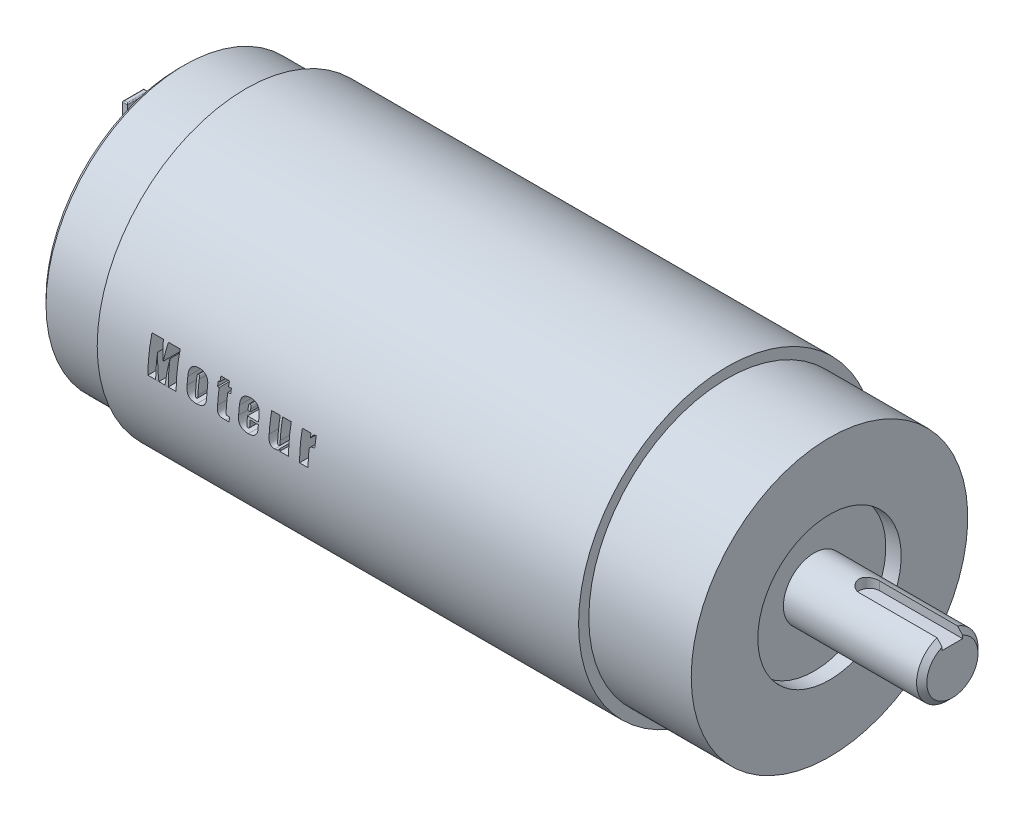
from build123d import *

# Parameters (mm, degrees)
CHANFREIN3_SIZE         = 0.5
ESQUISSE2_W             = 2
ESQUISSE2_H             = 1.5
ENL_V_MAT_EXTRU_1_DEPTH = 8.1
ESQUISSE3_R             = 1
ENL_V_MAT_EXTRU_2_DEPTH = 2.1
ENL_V_MAT_EXTRU_3_DEPTH = 2.1
BOSS_EXTRU_2_DEPTH      = 1.05
CONG_1_R                = 0.1


with BuildPart() as part:
    # Esquisse1 → Base-R_volution (revolve)
    with BuildSketch(Plane.XY, mode=Mode.PRIVATE) as base_r_volution_sk:
        with BuildLine():
            Line((12, 0), (12, 3))
            Line((12, 3), (-1.5, 3))
            Line((-1.5, 3), (-1.5, 7))
            Line((-1.5, 7), (0, 7))
            Line((0, 7), (0, 13.5))
            Line((0, 13.5), (-10, 13.5))
            Line((-10, 13.5), (-10, 14.5))
            Line((-10, 14.5), (-57, 14.5))
            Line((-57, 14.5), (-57, 13.5))
            Line((-57, 13.5), (-63, 13.5))
            Line((-63, 13.5), (-63.5, 13))
            Line((-63.5, 13), (-63.5, 8))
            ThreePointArc((-63.5, 8), (-64.207106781, 7.707106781), (-64.5, 7))
            Line((-64.5, 7), (-64.5, 0))
            Line((-64.5, 0), (12, 0))
        make_face()
    revolve(base_r_volution_sk.sketch.rotate(Axis((-76.5, 0, 0), (1, 0, 0)), 90), axis=Axis((-76.5, 0, 0), (1, 0, 0)))

    # Chanfrein3
    chanfrein3_edges = [part.edges().sort_by_distance(p)[0] for p in [
        (12, 0, -3),
    ]]
    chamfer(chanfrein3_edges, length=CHANFREIN3_SIZE)

    # Esquisse2 → Enl_v. mat.-Extru.1 (cut)
    with BuildSketch(Plane(origin=(12, 0, 0), x_dir=(0, 0, -1), z_dir=(1, 0, 0))):
        with Locations((0, 2.75)):
            Rectangle(ESQUISSE2_W, ESQUISSE2_H)
    extrude(amount=-ENL_V_MAT_EXTRU_1_DEPTH, mode=Mode.SUBTRACT)

    # Esquisse3 → Enl_v. mat.-Extru.2 (cut)
    with BuildSketch(Plane(origin=(0, 2, 0), x_dir=(-1, 0, 0), z_dir=(0, 1, 0))):
        with Locations((-3.9, 0)):
            Circle(ESQUISSE3_R)
    extrude(amount=ENL_V_MAT_EXTRU_2_DEPTH, mode=Mode.SUBTRACT)

    # Esquisse5 → Enl_v. mat.-Extru.3 (cut)
    # profile 1 of 6: a face of its own
    with BuildSketch(Plane.XY.offset(14.5)):
        with BuildLine():
            Line((-49.299123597, 3.393384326), (-49.299123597, 0))
            Line((-49.299123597, 0), (-50.057644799, 0))
            Line((-50.057644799, 0), (-50.077605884, 2.291158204))
            Line((-50.077605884, 2.291158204), (-50.377022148, 0))
            Line((-50.377022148, 0), (-50.975854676, 0))
            Line((-50.975854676, 0), (-51.27527094, 2.251236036))
            Line((-51.27527094, 2.251236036), (-51.295232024, 0))
            Line((-51.295232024, 0), (-52.053753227, 0))
            Line((-52.053753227, 0), (-52.053753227, 3.393384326))
            Line((-52.053753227, 3.393384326), (-50.94591305, 3.393384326))
            add(Edge.make_bspline(
                [(-50.94591305, 3.393384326), (-50.936773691, 3.340776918), (-50.917664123, 3.23077961), (-50.887600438, 3.058880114), (-50.855943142, 2.872721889), (-50.833857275, 2.744022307), (-50.822403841, 2.677280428)],
                knots=[0, 0, 0, 0, 0.881745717, 1.843650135, 2.881745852, 4, 4, 4, 4], degree=3))
            Line((-50.822403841, 2.677280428), (-50.676438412, 1.808973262))
            Line((-50.676438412, 1.808973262), (-50.446885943, 3.393384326))
            Line((-50.446885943, 3.393384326), (-49.299123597, 3.393384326))
        make_face()
    # profile 2 of 6: a face of its own
    with BuildSketch(Plane.XY.offset(14.5)):
        with BuildLine():
            Line((-46.344883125, 1.81022083), (-46.344883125, 1.130920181))
            add(Edge.make_bspline(
                [(-46.344883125, 1.130920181), (-46.344967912, 1.100768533), (-46.345131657, 1.042538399), (-46.3473617, 0.958336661), (-46.3492226, 0.880306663), (-46.35413174, 0.808612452), (-46.358451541, 0.743001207), (-46.365729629, 0.683801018), (-46.372852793, 0.630671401), (-46.384382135, 0.568225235), (-46.404301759, 0.495163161), (-46.438800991, 0.411384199), (-46.485249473, 0.331387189), (-46.540155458, 0.254185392), (-46.604961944, 0.183040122), (-46.680315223, 0.122344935), (-46.763390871, 0.070352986), (-46.85554118, 0.029541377), (-46.955529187, -0.001460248), (-47.062490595, -0.023601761), (-47.176424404, -0.037762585), (-47.254732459, -0.039189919), (-47.294905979, -0.039922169)],
                knots=[0, 0, 0, 0, 1.030820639, 1.990764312, 2.879836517, 3.698877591, 4.447479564, 5.127340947, 5.737592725, 6.27997261, 7.297519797, 8.320663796, 9.368189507, 10.453252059, 11.55504584, 12.646447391, 13.751149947, 14.896660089, 16.081551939, 17.323827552, 18.627072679, 20, 20, 20, 20], degree=3))
            add(Edge.make_bspline(
                [(-47.294905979, -0.039922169), (-47.339432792, -0.039331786), (-47.424916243, -0.038198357), (-47.547905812, -0.026065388), (-47.660369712, -0.007102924), (-47.762622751, 0.019096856), (-47.853913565, 0.054407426), (-47.935224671, 0.096316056), (-48.005305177, 0.147417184), (-48.06489423, 0.206214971), (-48.114319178, 0.272798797), (-48.156258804, 0.345506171), (-48.1905245, 0.424661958), (-48.213139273, 0.495537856), (-48.226884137, 0.55744323), (-48.236396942, 0.609842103), (-48.243322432, 0.66801972), (-48.250532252, 0.731374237), (-48.255450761, 0.800462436), (-48.258053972, 0.874951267), (-48.261064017, 0.954990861), (-48.261118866, 1.010110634), (-48.261147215, 1.038600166)],
                knots=[0, 0, 0, 0, 1.566851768, 3.008072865, 4.344862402, 5.578649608, 6.716279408, 7.783554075, 8.789251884, 9.757031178, 10.718730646, 11.699157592, 12.705361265, 13.749293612, 14.312132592, 14.936642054, 15.622938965, 16.373791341, 17.180992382, 18.06001777, 18.997289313, 20, 20, 20, 20], degree=3))
            Line((-48.261147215, 1.038600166), (-48.261147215, 1.749713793))
            add(Edge.make_bspline(
                [(-48.261147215, 1.749713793), (-48.260899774, 1.781112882), (-48.260419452, 1.842063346), (-48.256941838, 1.930936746), (-48.249689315, 2.014292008), (-48.241565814, 2.092658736), (-48.229319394, 2.165376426), (-48.216099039, 2.233234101), (-48.199145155, 2.295452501), (-48.179922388, 2.353202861), (-48.156383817, 2.406636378), (-48.129896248, 2.457501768), (-48.097982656, 2.50494139), (-48.06368723, 2.550780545), (-48.023463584, 2.592670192), (-47.980173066, 2.63259467), (-47.932255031, 2.669531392), (-47.880738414, 2.703819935), (-47.824864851, 2.734602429), (-47.765027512, 2.761021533), (-47.70193165, 2.784620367), (-47.634537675, 2.802354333), (-47.563696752, 2.816566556), (-47.488965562, 2.827314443), (-47.410622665, 2.833559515), (-47.357087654, 2.83416551), (-47.329837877, 2.834473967)],
                knots=[0, 0, 0, 0, 1.367165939, 2.653879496, 3.871100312, 5.009836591, 6.082946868, 7.080781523, 8.018528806, 8.888869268, 9.728143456, 10.558384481, 11.381984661, 12.214936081, 13.047543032, 13.906222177, 14.777268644, 15.678695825, 16.598484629, 17.550802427, 18.52460938, 19.528259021, 20.581129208, 21.669407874, 22.813708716, 24, 24, 24, 24], degree=3))
            add(Edge.make_bspline(
                [(-47.329837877, 2.834473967), (-47.284446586, 2.833734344), (-47.196883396, 2.832307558), (-47.070665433, 2.815247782), (-46.954005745, 2.790233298), (-46.848242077, 2.752000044), (-46.75286232, 2.706960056), (-46.668503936, 2.654903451), (-46.594987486, 2.597010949), (-46.534570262, 2.53136995), (-46.484498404, 2.462652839), (-46.441842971, 2.393042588), (-46.408866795, 2.321797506), (-46.387804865, 2.260519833), (-46.375407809, 2.208836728), (-46.36762006, 2.1656662), (-46.359723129, 2.118137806), (-46.35451626, 2.06562044), (-46.35013586, 2.008426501), (-46.347090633, 1.946440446), (-46.345213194, 1.879888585), (-46.344995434, 1.833925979), (-46.344883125, 1.81022083)],
                knots=[0, 0, 0, 0, 1.658815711, 3.199979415, 4.649957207, 6.01364259, 7.3027161, 8.501301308, 9.631864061, 10.713282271, 11.752046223, 12.737947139, 13.693922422, 14.617315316, 15.102372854, 15.636288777, 16.22136206, 16.863764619, 17.565366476, 18.319134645, 19.133096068, 20, 20, 20, 20], degree=3))
        make_face()
        with BuildLine():
            add(Edge.make_bspline(
                [(-47.183248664, 2.027297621), (-47.183485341, 2.044554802), (-47.183933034, 2.07719819), (-47.184131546, 2.123797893), (-47.186147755, 2.16517792), (-47.188569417, 2.201792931), (-47.191629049, 2.233203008), (-47.19504876, 2.259966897), (-47.20014578, 2.281315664), (-47.206169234, 2.303100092), (-47.218797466, 2.324219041), (-47.240115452, 2.343757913), (-47.269294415, 2.353217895), (-47.290076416, 2.35464692), (-47.301143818, 2.355407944)],
                knots=[0, 0, 0, 0, 1.585193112, 2.998524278, 4.279327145, 5.389603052, 6.36823621, 7.178467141, 7.864111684, 8.383615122, 9.248283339, 10.08726259, 10.981376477, 12, 12, 12, 12], degree=3))
            add(Edge.make_bspline(
                [(-47.301143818, 2.355407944), (-47.312454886, 2.354728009), (-47.333317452, 2.353473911), (-47.362411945, 2.343230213), (-47.384765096, 2.324570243), (-47.39769155, 2.303051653), (-47.404893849, 2.281461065), (-47.409465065, 2.259879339), (-47.414122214, 2.233290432), (-47.41654156, 2.201744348), (-47.420183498, 2.165220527), (-47.42180409, 2.123789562), (-47.422125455, 2.077200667), (-47.422554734, 2.044555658), (-47.422781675, 2.027297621)],
                knots=[0, 0, 0, 0, 1.033270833, 1.905804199, 2.770216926, 3.641090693, 4.164334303, 4.847116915, 5.656874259, 6.631422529, 7.738535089, 9.013991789, 10.421423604, 12, 12, 12, 12], degree=3))
            Line((-47.422781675, 2.027297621), (-47.422781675, 0.759144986))
            add(Edge.make_bspline(
                [(-47.422781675, 0.759144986), (-47.422748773, 0.728775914), (-47.422689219, 0.67380794), (-47.417538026, 0.599902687), (-47.411051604, 0.543207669), (-47.401131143, 0.501627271), (-47.385260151, 0.472234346), (-47.362888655, 0.452634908), (-47.334611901, 0.440884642), (-47.313946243, 0.43974609), (-47.30301517, 0.439143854)],
                knots=[0, 0, 0, 0, 1.905444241, 3.448851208, 4.646660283, 5.485608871, 6.116872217, 6.708589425, 7.316910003, 8, 8, 8, 8], degree=3))
            add(Edge.make_bspline(
                [(-47.30301517, 0.439143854), (-47.291700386, 0.439822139), (-47.270830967, 0.441073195), (-47.242062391, 0.451237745), (-47.219929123, 0.469312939), (-47.204385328, 0.496438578), (-47.19439329, 0.534424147), (-47.187731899, 0.586141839), (-47.183603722, 0.653454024), (-47.183375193, 0.703413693), (-47.183248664, 0.731074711)],
                knots=[0, 0, 0, 0, 0.759541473, 1.400927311, 2.016662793, 2.637613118, 3.469132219, 4.641499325, 6.140509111, 8, 8, 8, 8], degree=3))
            Line((-47.183248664, 0.731074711), (-47.183248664, 2.027297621))
        make_face(mode=Mode.SUBTRACT)
    # profile 3 of 6: a face of its own
    with BuildSketch(Plane.XY.offset(14.5)):
        with BuildLine():
            Line((-44.428619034, 3.153851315), (-44.428619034, 2.714707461))
            Line((-44.428619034, 2.714707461), (-44.149163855, 2.714707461))
            Line((-44.149163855, 2.714707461), (-44.149163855, 2.275563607))
            Line((-44.149163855, 2.275563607), (-44.428619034, 2.275563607))
            Line((-44.428619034, 2.275563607), (-44.428619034, 0.778482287))
            add(Edge.make_bspline(
                [(-44.428619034, 0.778482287), (-44.428426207, 0.756650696), (-44.428064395, 0.715686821), (-44.427331, 0.658045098), (-44.423996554, 0.608138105), (-44.420195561, 0.565732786), (-44.416655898, 0.530747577), (-44.410153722, 0.503696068), (-44.403998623, 0.483839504), (-44.395242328, 0.469517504), (-44.380868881, 0.461490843), (-44.361815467, 0.455664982), (-44.33599372, 0.451046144), (-44.303731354, 0.446831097), (-44.264632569, 0.442985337), (-44.218845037, 0.440700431), (-44.16621922, 0.43962148), (-44.12899529, 0.439309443), (-44.109241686, 0.439143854)],
                knots=[0, 0, 0, 0, 1.739732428, 3.26436042, 4.592396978, 5.723406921, 6.6584426, 7.389883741, 7.934871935, 8.316298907, 8.688621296, 9.212551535, 9.90465525, 10.773969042, 11.805991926, 13.033823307, 14.425940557, 16, 16, 16, 16], degree=3))
            Line((-44.109241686, 0.439143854), (-44.109241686, 0))
            Line((-44.109241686, 0), (-44.4647985, 0))
            add(Edge.make_bspline(
                [(-44.4647985, 0), (-44.488917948, 0.000230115), (-44.535493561, 0.000674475), (-44.602665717, 0.000957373), (-44.664446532, 0.002707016), (-44.720762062, 0.006185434), (-44.771731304, 0.009072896), (-44.817540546, 0.012581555), (-44.857866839, 0.017681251), (-44.904251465, 0.024719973), (-44.956971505, 0.038580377), (-45.016260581, 0.062041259), (-45.07095704, 0.09478594), (-45.121860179, 0.133278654), (-45.165466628, 0.178333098), (-45.201392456, 0.227051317), (-45.227729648, 0.279104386), (-45.242703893, 0.326546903), (-45.249497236, 0.370210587), (-45.25463612, 0.412417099), (-45.257977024, 0.464275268), (-45.260866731, 0.52563433), (-45.264318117, 0.596307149), (-45.266039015, 0.676381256), (-45.266315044, 0.766006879), (-45.266754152, 0.829008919), (-45.266984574, 0.862069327)],
                knots=[0, 0, 0, 0, 1.195583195, 2.308718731, 3.329517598, 4.258521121, 5.105212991, 5.860114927, 6.535083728, 7.11964657, 8.184549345, 9.22951552, 10.268875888, 11.334626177, 12.384156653, 13.365429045, 14.324142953, 15.262984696, 15.817041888, 16.512473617, 17.370134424, 18.391765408, 19.557524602, 20.877102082, 22.361254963, 24, 24, 24, 24], degree=3))
            Line((-45.266984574, 0.862069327), (-45.266984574, 2.275563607))
            Line((-45.266984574, 2.275563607), (-45.426673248, 2.275563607))
            Line((-45.426673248, 2.275563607), (-45.426673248, 2.714707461))
            Line((-45.426673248, 2.714707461), (-45.266984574, 2.714707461))
            Line((-45.266984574, 2.714707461), (-45.266984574, 3.153851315))
            Line((-45.266984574, 3.153851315), (-44.428619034, 3.153851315))
        make_face()
    # profile 4 of 6: a face of its own
    with BuildSketch(Plane.XY.offset(14.5)):
        with BuildLine():
            Line((-41.314689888, 1.357353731), (-42.392588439, 1.357353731))
            Line((-42.392588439, 1.357353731), (-42.392588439, 0.742926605))
            add(Edge.make_bspline(
                [(-42.392588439, 0.742926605), (-42.392156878, 0.713611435), (-42.391378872, 0.660762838), (-42.387819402, 0.589800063), (-42.380227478, 0.536117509), (-42.369922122, 0.496551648), (-42.352177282, 0.46967848), (-42.329285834, 0.451005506), (-42.299515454, 0.441207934), (-42.278085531, 0.439864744), (-42.266584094, 0.439143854)],
                knots=[0, 0, 0, 0, 1.890715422, 3.408530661, 4.574570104, 5.388719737, 6.017101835, 6.617997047, 7.258279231, 8, 8, 8, 8], degree=3))
            add(Edge.make_bspline(
                [(-42.266584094, 0.439143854), (-42.252534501, 0.439825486), (-42.225936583, 0.441115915), (-42.189627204, 0.454895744), (-42.161517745, 0.47911855), (-42.141290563, 0.513834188), (-42.12857809, 0.561147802), (-42.118905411, 0.623003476), (-42.114064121, 0.701478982), (-42.113462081, 0.759349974), (-42.113133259, 0.790957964)],
                knots=[0, 0, 0, 0, 0.77490214, 1.46700222, 2.10332186, 2.789855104, 3.655878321, 4.798107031, 6.251189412, 8, 8, 8, 8], degree=3))
            Line((-42.113133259, 0.790957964), (-42.113133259, 1.157742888))
            Line((-42.113133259, 1.157742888), (-41.314689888, 1.157742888))
            Line((-41.314689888, 1.157742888), (-41.314689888, 0.954389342))
            add(Edge.make_bspline(
                [(-41.314689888, 0.954389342), (-41.314935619, 0.914456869), (-41.315397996, 0.839318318), (-41.321683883, 0.733996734), (-41.331114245, 0.643102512), (-41.345276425, 0.563942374), (-41.367572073, 0.490968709), (-41.399910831, 0.418784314), (-41.443673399, 0.344655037), (-41.496139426, 0.269043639), (-41.55783716, 0.196668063), (-41.629233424, 0.133000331), (-41.708377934, 0.078918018), (-41.796226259, 0.034775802), (-41.893794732, 0.001068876), (-42.001932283, -0.023086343), (-42.121702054, -0.037197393), (-42.205414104, -0.038987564), (-42.249118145, -0.039922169)],
                knots=[0, 0, 0, 0, 1.220515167, 2.296570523, 3.223795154, 4.012896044, 4.750775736, 5.550378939, 6.424703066, 7.37864369, 8.361063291, 9.324380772, 10.294010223, 11.283212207, 12.320479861, 13.441475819, 14.664256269, 16, 16, 16, 16], degree=3))
            add(Edge.make_bspline(
                [(-42.249118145, -0.039922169), (-42.291990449, -0.038962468), (-42.375283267, -0.03709795), (-42.496432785, -0.022719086), (-42.609789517, 0.001629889), (-42.715133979, 0.034748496), (-42.810610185, 0.077427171), (-42.896322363, 0.12613958), (-42.970058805, 0.183674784), (-43.033009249, 0.247478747), (-43.084461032, 0.317383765), (-43.128063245, 0.390260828), (-43.163053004, 0.466566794), (-43.185518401, 0.533537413), (-43.198476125, 0.590727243), (-43.207179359, 0.638181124), (-43.214574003, 0.690208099), (-43.22096265, 0.746768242), (-43.22481207, 0.808197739), (-43.228988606, 0.874078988), (-43.230552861, 0.944609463), (-43.230817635, 0.99306401), (-43.230953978, 1.018015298)],
                knots=[0, 0, 0, 0, 1.537654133, 2.987372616, 4.368384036, 5.691691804, 6.940509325, 8.113616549, 9.219168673, 10.284591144, 11.318370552, 12.325076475, 13.326324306, 14.324037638, 14.852344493, 15.428744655, 16.05425501, 16.737084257, 17.469900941, 18.261790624, 19.104922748, 20, 20, 20, 20], degree=3))
            Line((-43.230953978, 1.018015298), (-43.230953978, 1.827062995))
            add(Edge.make_bspline(
                [(-43.230953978, 1.827062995), (-43.230854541, 1.856599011), (-43.230661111, 1.9140539), (-43.225127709, 1.997869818), (-43.218134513, 2.07680208), (-43.2074311, 2.150912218), (-43.193856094, 2.220294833), (-43.177049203, 2.284819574), (-43.157938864, 2.34488446), (-43.134544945, 2.399980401), (-43.10828856, 2.451604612), (-43.078294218, 2.500014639), (-43.043815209, 2.544944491), (-43.005634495, 2.586669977), (-42.964255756, 2.625862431), (-42.918459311, 2.661483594), (-42.868575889, 2.693647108), (-42.797039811, 2.733141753), (-42.70074626, 2.774441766), (-42.57657365, 2.809111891), (-42.444508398, 2.830928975), (-42.353585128, 2.833275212), (-42.307130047, 2.834473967)],
                knots=[0, 0, 0, 0, 1.12670721, 2.191725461, 3.20380226, 4.149652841, 5.047431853, 5.899896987, 6.692718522, 7.450092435, 8.181033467, 8.900911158, 9.619738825, 10.338610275, 11.057043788, 11.791849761, 12.548849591, 13.319447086, 14.908124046, 16.532998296, 18.228617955, 20, 20, 20, 20], degree=3))
            add(Edge.make_bspline(
                [(-42.307130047, 2.834473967), (-42.278424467, 2.83417374), (-42.222189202, 2.833585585), (-42.139913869, 2.827259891), (-42.06137321, 2.816712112), (-41.986822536, 2.801757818), (-41.915885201, 2.783138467), (-41.849032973, 2.760258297), (-41.786335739, 2.732327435), (-41.727052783, 2.701557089), (-41.672321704, 2.666406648), (-41.62136526, 2.628818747), (-41.574607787, 2.588588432), (-41.532691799, 2.54500122), (-41.494208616, 2.499526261), (-41.460669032, 2.450694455), (-41.430966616, 2.399291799), (-41.406134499, 2.344347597), (-41.383918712, 2.28569236), (-41.365341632, 2.221843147), (-41.350042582, 2.152384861), (-41.33679093, 2.077499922), (-41.327141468, 1.996675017), (-41.319611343, 1.910353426), (-41.315225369, 1.818375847), (-41.31487182, 1.755332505), (-41.314689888, 1.722891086)],
                knots=[0, 0, 0, 0, 1.200085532, 2.351010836, 3.44779253, 4.511760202, 5.528240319, 6.512570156, 7.462430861, 8.395794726, 9.302664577, 10.179057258, 11.041933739, 11.878116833, 12.70521071, 13.530016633, 14.35174671, 15.184260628, 16.048187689, 16.972559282, 17.961791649, 19.020952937, 20.15110093, 21.364092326, 22.643590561, 24, 24, 24, 24], degree=3))
            Line((-41.314689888, 1.722891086), (-41.314689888, 1.357353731))
        make_face()
        with BuildLine():
            Line((-42.153055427, 1.796497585), (-42.153055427, 2.004841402))
            add(Edge.make_bspline(
                [(-42.153055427, 2.004841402), (-42.153294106, 2.022514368), (-42.153749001, 2.056197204), (-42.153919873, 2.104253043), (-42.155998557, 2.147291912), (-42.15832038, 2.185370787), (-42.161580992, 2.218626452), (-42.164700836, 2.247087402), (-42.170190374, 2.270443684), (-42.175959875, 2.294811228), (-42.187799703, 2.318909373), (-42.208414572, 2.340846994), (-42.235789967, 2.353828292), (-42.256051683, 2.354867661), (-42.266584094, 2.355407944)],
                knots=[0, 0, 0, 0, 1.560701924, 2.974535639, 4.242567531, 5.36492845, 6.342325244, 7.194035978, 7.889050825, 8.459096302, 9.403339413, 10.221335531, 11.075417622, 12, 12, 12, 12], degree=3))
            add(Edge.make_bspline(
                [(-42.266584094, 2.355407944), (-42.27957772, 2.355074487), (-42.303405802, 2.354462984), (-42.335197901, 2.343675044), (-42.359789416, 2.326230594), (-42.372535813, 2.304236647), (-42.377391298, 2.28188654), (-42.382162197, 2.25953144), (-42.384523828, 2.23127125), (-42.388239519, 2.197460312), (-42.389375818, 2.157451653), (-42.391807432, 2.111742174), (-42.391873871, 2.060146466), (-42.392341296, 2.023969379), (-42.392588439, 2.004841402)],
                knots=[0, 0, 0, 0, 1.096765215, 2.011279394, 2.804742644, 3.603088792, 4.094906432, 4.741565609, 5.539911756, 6.496140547, 7.62586072, 8.931738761, 10.37771264, 12, 12, 12, 12], degree=3))
            Line((-42.392588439, 2.004841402), (-42.392588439, 1.796497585))
            Line((-42.392588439, 1.796497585), (-42.153055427, 1.796497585))
        make_face(mode=Mode.SUBTRACT)
    # profile 5 of 6: a face of its own
    with BuildSketch(Plane.XY.offset(14.5)):
        with BuildLine():
            Line((-38.320527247, 2.794551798), (-38.320527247, 0))
            Line((-38.320527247, 0), (-39.172616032, 0))
            Line((-39.172616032, 0), (-39.158892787, 0.238909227))
            add(Edge.make_bspline(
                [(-39.158892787, 0.238909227), (-39.173491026, 0.216639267), (-39.201911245, 0.173283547), (-39.253486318, 0.116759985), (-39.309065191, 0.068094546), (-39.370080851, 0.028621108), (-39.435692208, -0.002417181), (-39.506253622, -0.024161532), (-39.581517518, -0.037556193), (-39.633327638, -0.039122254), (-39.659791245, -0.039922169)],
                knots=[0, 0, 0, 0, 1.061666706, 2.066879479, 3.043894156, 4.004116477, 4.958543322, 5.932696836, 6.944061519, 8, 8, 8, 8], degree=3))
            add(Edge.make_bspline(
                [(-39.659791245, -0.039922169), (-39.689577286, -0.039125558), (-39.74672736, -0.037597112), (-39.828532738, -0.02486441), (-39.902905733, -0.004925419), (-39.96872279, 0.024884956), (-40.026886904, 0.060787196), (-40.075471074, 0.104284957), (-40.118710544, 0.150818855), (-40.150982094, 0.204597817), (-40.177191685, 0.260850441), (-40.197370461, 0.318706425), (-40.213523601, 0.377359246), (-40.222028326, 0.428309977), (-40.225814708, 0.473639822), (-40.2290441, 0.515000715), (-40.231449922, 0.563882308), (-40.233091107, 0.620039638), (-40.235170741, 0.683656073), (-40.236292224, 0.754774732), (-40.236935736, 0.833374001), (-40.236840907, 0.888268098), (-40.236791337, 0.916962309)],
                knots=[0, 0, 0, 0, 1.372356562, 2.633121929, 3.807600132, 4.910298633, 5.952776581, 6.944670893, 7.908661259, 8.868831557, 9.820833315, 10.766735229, 11.689826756, 12.622720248, 13.142547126, 13.786556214, 14.535201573, 15.398368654, 16.376504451, 17.469410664, 18.677211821, 20, 20, 20, 20], degree=3))
            Line((-40.236791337, 0.916962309), (-40.236791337, 2.794551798))
            Line((-40.236791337, 2.794551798), (-39.398425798, 2.794551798))
            Line((-39.398425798, 2.794551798), (-39.398425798, 0.888892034))
            add(Edge.make_bspline(
                [(-39.398425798, 0.888892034), (-39.398560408, 0.862899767), (-39.398814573, 0.813822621), (-39.397136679, 0.744382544), (-39.396195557, 0.683446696), (-39.394326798, 0.630833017), (-39.391945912, 0.586521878), (-39.388933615, 0.550319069), (-39.385492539, 0.522343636), (-39.380236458, 0.49689333), (-39.369305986, 0.472534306), (-39.345888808, 0.452728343), (-39.315297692, 0.440586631), (-39.292303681, 0.439649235), (-39.27990686, 0.439143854)],
                knots=[0, 0, 0, 0, 1.812042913, 3.421398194, 4.842335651, 6.06080483, 7.091677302, 7.935583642, 8.593692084, 9.054393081, 9.748100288, 10.405409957, 11.140304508, 12, 12, 12, 12], degree=3))
            add(Edge.make_bspline(
                [(-39.27990686, 0.439143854), (-39.266700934, 0.439643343), (-39.242528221, 0.440557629), (-39.209967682, 0.452443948), (-39.186287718, 0.473554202), (-39.175430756, 0.498975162), (-39.171611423, 0.525374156), (-39.1673932, 0.554419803), (-39.16572357, 0.592393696), (-39.16288049, 0.638932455), (-39.161159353, 0.694263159), (-39.160167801, 0.758312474), (-39.158510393, 0.831289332), (-39.15876062, 0.882861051), (-39.158892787, 0.910100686)],
                knots=[0, 0, 0, 0, 0.876067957, 1.603593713, 2.260088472, 2.929160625, 3.393475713, 4.035657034, 4.88190587, 5.921621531, 7.140530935, 8.566649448, 10.186540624, 12, 12, 12, 12], degree=3))
            Line((-39.158892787, 0.910100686), (-39.158892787, 2.794551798))
            Line((-39.158892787, 2.794551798), (-38.320527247, 2.794551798))
        make_face()
    # profile 6 of 6: a face of its own
    with BuildSketch(Plane.XY.offset(14.5)):
        with BuildLine():
            Line((-36.404263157, 2.794551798), (-36.404263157, 2.398449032))
            add(Edge.make_bspline(
                [(-36.404263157, 2.398449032), (-36.389114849, 2.431018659), (-36.359939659, 2.493746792), (-36.30716456, 2.579065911), (-36.249926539, 2.652809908), (-36.187187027, 2.714277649), (-36.118782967, 2.76291127), (-36.045889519, 2.800314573), (-35.96743901, 2.82548977), (-35.912895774, 2.83145378), (-35.885274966, 2.834473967)],
                knots=[0, 0, 0, 0, 1.204290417, 2.319427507, 3.357749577, 4.3296402, 5.254947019, 6.16283874, 7.069657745, 8, 8, 8, 8], degree=3))
            Line((-35.885274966, 2.834473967), (-35.885274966, 1.836419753))
            add(Edge.make_bspline(
                [(-35.885274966, 1.836419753), (-35.922743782, 1.835883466), (-35.992700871, 1.834882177), (-36.089650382, 1.823112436), (-36.171269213, 1.804991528), (-36.237534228, 1.777201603), (-36.289925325, 1.742263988), (-36.331515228, 1.701550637), (-36.361232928, 1.653757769), (-36.377339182, 1.608194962), (-36.385176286, 1.565468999), (-36.389589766, 1.5239372), (-36.395176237, 1.473700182), (-36.397352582, 1.414110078), (-36.401079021, 1.345538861), (-36.402469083, 1.267739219), (-36.403839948, 1.181035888), (-36.404117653, 1.120316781), (-36.404263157, 1.088502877)],
                knots=[0, 0, 0, 0, 1.627085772, 3.037891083, 4.236500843, 5.248388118, 6.140412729, 6.95810854, 7.75773763, 8.563569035, 9.041963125, 9.642594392, 10.377937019, 11.23738796, 12.232192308, 13.361810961, 14.617715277, 16, 16, 16, 16], degree=3))
            Line((-36.404263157, 1.088502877), (-36.404263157, 0))
            Line((-36.404263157, 0), (-37.242628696, 0))
            Line((-37.242628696, 0), (-37.242628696, 2.794551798))
            Line((-37.242628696, 2.794551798), (-36.404263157, 2.794551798))
        make_face()
    extrude(amount=-ENL_V_MAT_EXTRU_3_DEPTH, mode=Mode.SUBTRACT)

    # Esquisse6 → Boss.-Extru.2 (add, symmetric)
    with BuildSketch(Plane.XY):
        with BuildLine():
            Line((-62, 5), (-66, 5))
            ThreePointArc((-66, 5), (-67.060660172, 5.439339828), (-67.5, 6.5))
            Line((-67.5, 6.5), (-67.5, 8.5))
            Line((-67.5, 8.5), (-68, 8.5))
            Line((-68, 8.5), (-68, 6.5))
            ThreePointArc((-68, 6.5), (-67.414213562, 5.085786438), (-66, 4.5))
            Line((-66, 4.5), (-62, 4.5))
            Line((-62, 4.5), (-62, 5))
        make_face()
        with BuildLine():
            Line((-62, -4.5), (-62, -5))
            Line((-62, -5), (-66, -5))
            ThreePointArc((-66, -5), (-67.060660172, -5.439339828), (-67.5, -6.5))
            Line((-67.5, -6.5), (-67.5, -8.5))
            Line((-67.5, -8.5), (-68, -8.5))
            Line((-68, -8.5), (-68, -6.5))
            ThreePointArc((-68, -6.5), (-67.414213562, -5.085786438), (-66, -4.5))
            Line((-66, -4.5), (-62, -4.5))
        make_face()
    extrude(amount=BOSS_EXTRU_2_DEPTH, both=True)

    # Cong_1
    cong_1_edges = [part.edges().sort_by_distance(p)[0] for p in [
        (-67.75, 8.5, -1.05),
        (-67.75, 8.5, 1.05),
        (-68, 8.5, 0),
        (-67.5, 8.5, 0),
    ]]
    fillet(cong_1_edges, radius=CONG_1_R)


solid = part.part
